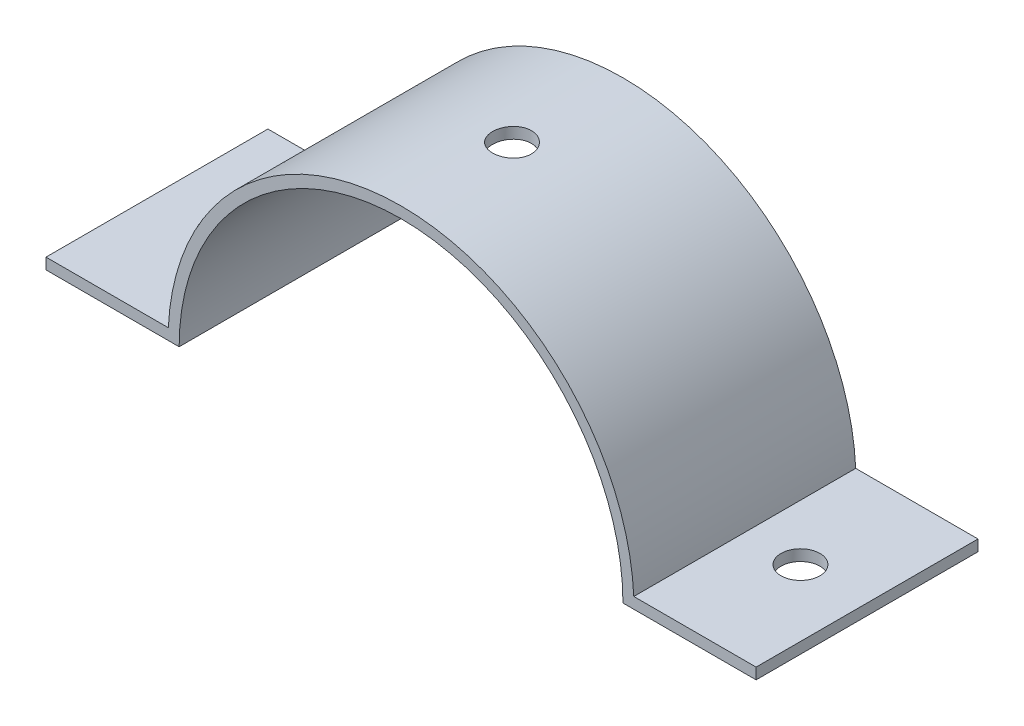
ISO-10303-21;
HEADER;
FILE_DESCRIPTION(('STEP AP214'),'2;1');
FILE_NAME('part.step','',(''),(''),'','','');
FILE_SCHEMA(('AUTOMOTIVE_DESIGN { 1 0 10303 214 1 1 1 1 }'));
ENDSEC;
DATA;
#1=APPLICATION_CONTEXT('core data for automotive mechanical design processes');
#2=APPLICATION_PROTOCOL_DEFINITION('international standard','automotive_design',2000,#1);
#3=PRODUCT_CONTEXT('',#1,'mechanical');
#4=PRODUCT('Part','Part','',(#3));
#5=PRODUCT_RELATED_PRODUCT_CATEGORY('part','',(#4));
#6=PRODUCT_DEFINITION_FORMATION('','',#4);
#7=PRODUCT_DEFINITION_CONTEXT('part definition',#1,'design');
#8=PRODUCT_DEFINITION('design','',#6,#7);
#9=PRODUCT_DEFINITION_SHAPE('','',#8);
#10=(LENGTH_UNIT() NAMED_UNIT(*) SI_UNIT(.MILLI.,.METRE.));
#11=(NAMED_UNIT(*) PLANE_ANGLE_UNIT() SI_UNIT($,.RADIAN.));
#12=(NAMED_UNIT(*) SI_UNIT($,.STERADIAN.) SOLID_ANGLE_UNIT());
#13=UNCERTAINTY_MEASURE_WITH_UNIT(LENGTH_MEASURE(1.E-05),#10,'distance_accuracy_value','');
#14=(GEOMETRIC_REPRESENTATION_CONTEXT(3) GLOBAL_UNCERTAINTY_ASSIGNED_CONTEXT((#13)) GLOBAL_UNIT_ASSIGNED_CONTEXT((#10,
#11,#12)) REPRESENTATION_CONTEXT('',''));
#15=CARTESIAN_POINT('',(0.,0.,0.));
#16=DIRECTION('',(0.,0.,1.));
#17=DIRECTION('',(1.,0.,0.));
#18=AXIS2_PLACEMENT_3D('',#15,#16,#17);
#19=CARTESIAN_POINT('',(0.,0.,20.));
#20=DIRECTION('',(0.,0.,-1.));
#21=DIRECTION('',(-1.,0.,0.));
#22=AXIS2_PLACEMENT_3D('',#19,#20,#21);
#23=CYLINDRICAL_SURFACE('',#22,21.);
#24=CARTESIAN_POINT('',(0.,0.,0.));
#25=DIRECTION('',(0.,0.,1.));
#26=DIRECTION('',(1.,0.,0.));
#27=AXIS2_PLACEMENT_3D('',#24,#25,#26);
#28=CIRCLE('',#27,21.);
#29=CARTESIAN_POINT('',(20.976176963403,1.,0.));
#30=VERTEX_POINT('',#29);
#31=CARTESIAN_POINT('',(-20.976176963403,1.,0.));
#32=VERTEX_POINT('',#31);
#33=EDGE_CURVE('E134',#30,#32,#28,.T.);
#34=ORIENTED_EDGE('',*,*,#33,.T.);
#35=DIRECTION('',(0.,0.,-1.));
#36=VECTOR('',#35,1.);
#37=CARTESIAN_POINT('',(-20.976176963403,1.,20.));
#38=LINE('',#37,#36);
#39=CARTESIAN_POINT('',(-20.976176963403,1.,20.));
#40=VERTEX_POINT('',#39);
#41=EDGE_CURVE('E11',#40,#32,#38,.T.);
#42=ORIENTED_EDGE('',*,*,#41,.F.);
#43=CARTESIAN_POINT('',(0.,0.,20.));
#44=DIRECTION('',(0.,0.,1.));
#45=DIRECTION('',(1.,0.,0.));
#46=AXIS2_PLACEMENT_3D('',#43,#44,#45);
#47=CIRCLE('',#46,21.);
#48=CARTESIAN_POINT('',(20.976176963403,1.,20.));
#49=VERTEX_POINT('',#48);
#50=EDGE_CURVE('E149',#49,#40,#47,.T.);
#51=ORIENTED_EDGE('',*,*,#50,.F.);
#52=DIRECTION('',(0.,0.,-1.));
#53=VECTOR('',#52,1.);
#54=CARTESIAN_POINT('',(20.976176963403,1.,20.));
#55=LINE('',#54,#53);
#56=EDGE_CURVE('E130',#49,#30,#55,.T.);
#57=ORIENTED_EDGE('',*,*,#56,.T.);
#58=EDGE_LOOP('',(#34,#42,#51,#57));
#59=FACE_BOUND('',#58,.T.);
#60=CARTESIAN_POINT('',(0.,21.,8.25));
#61=CARTESIAN_POINT('',(-0.0981156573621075,20.9999990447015,8.25000428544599));
#62=CARTESIAN_POINT('',(-0.196298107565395,20.9993050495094,8.25827919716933));
#63=CARTESIAN_POINT('',(-0.389946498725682,20.9966032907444,8.29116761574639));
#64=CARTESIAN_POINT('',(-0.485409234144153,20.9945940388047,8.31579963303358));
#65=CARTESIAN_POINT('',(-0.670785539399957,20.9894888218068,8.3806850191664));
#66=CARTESIAN_POINT('',(-0.760702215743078,20.9863934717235,8.42092954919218));
#67=CARTESIAN_POINT('',(-0.932482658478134,20.9794631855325,8.51588175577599));
#68=CARTESIAN_POINT('',(-1.01434814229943,20.9756284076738,8.57058633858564));
#69=CARTESIAN_POINT('',(-1.16793249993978,20.9676386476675,8.69305636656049));
#70=CARTESIAN_POINT('',(-1.23962802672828,20.9634829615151,8.76085104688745));
#71=CARTESIAN_POINT('',(-1.37063698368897,20.9553256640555,8.90751506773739));
#72=CARTESIAN_POINT('',(-1.42994986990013,20.9513240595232,8.98638489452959));
#73=CARTESIAN_POINT('',(-1.5345888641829,20.9439204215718,9.1531017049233));
#74=CARTESIAN_POINT('',(-1.5798944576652,20.9405192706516,9.24096160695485));
#75=CARTESIAN_POINT('',(-1.65510175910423,20.9347096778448,9.42307451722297));
#76=CARTESIAN_POINT('',(-1.68500373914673,20.9323012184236,9.51732741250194));
#77=CARTESIAN_POINT('',(-1.7284873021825,20.9287556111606,9.70931693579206));
#78=CARTESIAN_POINT('',(-1.74210691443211,20.9276155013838,9.80704489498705));
#79=CARTESIAN_POINT('',(-1.752756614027,20.9267263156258,10.0034058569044));
#80=CARTESIAN_POINT('',(-1.74978701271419,20.9269772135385,10.1020388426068));
#81=CARTESIAN_POINT('',(-1.72737401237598,20.9288390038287,10.2971494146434));
#82=CARTESIAN_POINT('',(-1.7079719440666,20.9304464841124,10.3936317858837));
#83=CARTESIAN_POINT('',(-1.65330897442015,20.9348349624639,10.5819657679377));
#84=CARTESIAN_POINT('',(-1.61804791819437,20.937615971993,10.6738173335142));
#85=CARTESIAN_POINT('',(-1.53262162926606,20.9440420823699,10.8504140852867));
#86=CARTESIAN_POINT('',(-1.48243785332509,20.9476882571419,10.9351502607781));
#87=CARTESIAN_POINT('',(-1.36860402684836,20.9554328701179,11.0950123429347));
#88=CARTESIAN_POINT('',(-1.30495370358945,20.9595313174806,11.1701380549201));
#89=CARTESIAN_POINT('',(-1.16576176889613,20.9677338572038,11.3088869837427));
#90=CARTESIAN_POINT('',(-1.09018442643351,20.9718379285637,11.3724743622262));
#91=CARTESIAN_POINT('',(-0.929408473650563,20.9795773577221,11.48606451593));
#92=CARTESIAN_POINT('',(-0.844209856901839,20.9832127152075,11.5360672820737));
#93=CARTESIAN_POINT('',(-0.666586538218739,20.9896058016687,11.6210665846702));
#94=CARTESIAN_POINT('',(-0.574161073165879,20.9923634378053,11.6560615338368));
#95=CARTESIAN_POINT('',(-0.384718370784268,20.9966893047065,11.7100267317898));
#96=CARTESIAN_POINT('',(-0.287701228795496,20.9982575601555,11.7289973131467));
#97=CARTESIAN_POINT('',(-0.0921397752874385,21.0000247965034,11.7503303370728));
#98=CARTESIAN_POINT('',(0.00639910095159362,21.00022785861,11.7527422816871));
#99=CARTESIAN_POINT('',(0.202479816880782,20.9992527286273,11.7410192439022));
#100=CARTESIAN_POINT('',(0.300021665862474,20.9980745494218,11.7268844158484));
#101=CARTESIAN_POINT('',(0.491198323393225,20.9944720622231,11.6825100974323));
#102=CARTESIAN_POINT('',(0.584838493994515,20.9920495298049,11.6522935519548));
#103=CARTESIAN_POINT('',(0.765719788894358,20.9862304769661,11.5766369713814));
#104=CARTESIAN_POINT('',(0.852960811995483,20.9828339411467,11.5311966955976));
#105=CARTESIAN_POINT('',(1.01879263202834,20.9754374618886,11.4262581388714));
#106=CARTESIAN_POINT('',(1.09736261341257,20.9714361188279,11.3667270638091));
#107=CARTESIAN_POINT('',(1.24341191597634,20.9632842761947,11.2353441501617));
#108=CARTESIAN_POINT('',(1.31089104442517,20.9591337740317,11.1634920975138));
#109=CARTESIAN_POINT('',(1.43301295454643,20.9511393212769,11.0092920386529));
#110=CARTESIAN_POINT('',(1.48762343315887,20.9472961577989,10.9269184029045));
#111=CARTESIAN_POINT('',(1.58223635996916,20.9403626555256,10.754141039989));
#112=CARTESIAN_POINT('',(1.62223895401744,20.937272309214,10.6637373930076));
#113=CARTESIAN_POINT('',(1.68644556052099,20.9321987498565,10.4775806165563));
#114=CARTESIAN_POINT('',(1.71066934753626,20.9302141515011,10.3818343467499));
#115=CARTESIAN_POINT('',(1.74269509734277,20.9275721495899,10.1876162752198));
#116=CARTESIAN_POINT('',(1.75049737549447,20.926914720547,10.0891445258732));
#117=CARTESIAN_POINT('',(1.74945498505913,20.9270018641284,9.89259177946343));
#118=CARTESIAN_POINT('',(1.74066107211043,20.9277421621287,9.79451050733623));
#119=CARTESIAN_POINT('',(1.7067817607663,20.9305322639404,9.60122306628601));
#120=CARTESIAN_POINT('',(1.68169633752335,20.9325820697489,9.50601690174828));
#121=CARTESIAN_POINT('',(1.61595894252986,20.9377590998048,9.32117891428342));
#122=CARTESIAN_POINT('',(1.57530788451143,20.9408862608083,9.23154676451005));
#123=CARTESIAN_POINT('',(1.47959885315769,20.9478657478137,9.06037102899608));
#124=CARTESIAN_POINT('',(1.42454110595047,20.9517180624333,8.97882731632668));
#125=CARTESIAN_POINT('',(1.30139089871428,20.9597278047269,8.82588345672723));
#126=CARTESIAN_POINT('',(1.23326086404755,20.9638860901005,8.75451360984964));
#127=CARTESIAN_POINT('',(1.08596814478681,20.9720314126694,8.62419342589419));
#128=CARTESIAN_POINT('',(1.00680279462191,20.9760184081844,8.56524609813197));
#129=CARTESIAN_POINT('',(0.839534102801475,20.9833791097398,8.46136524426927));
#130=CARTESIAN_POINT('',(0.751414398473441,20.9867516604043,8.41645800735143));
#131=CARTESIAN_POINT('',(0.568917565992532,20.9924899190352,8.34213434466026));
#132=CARTESIAN_POINT('',(0.474547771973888,20.9948567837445,8.31270011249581));
#133=CARTESIAN_POINT('',(0.316351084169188,20.9977093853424,8.27765423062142));
#134=CARTESIAN_POINT('',(0.253541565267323,20.9985644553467,8.2672976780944));
#135=CARTESIAN_POINT('',(0.127164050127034,20.9997100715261,8.25346918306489));
#136=CARTESIAN_POINT('',(0.0635960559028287,21.0000006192,8.24999722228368));
#137=CARTESIAN_POINT('',(0.,21.,8.25));
#138=B_SPLINE_CURVE_WITH_KNOTS('',3,(#60,#61,#62,#63,#64,#65,#66,#67,#68,#69,#70,#71,#72,#73,
#74,#75,#76,#77,#78,#79,#80,#81,#82,#83,#84,#85,#86,#87,#88,#89,#90,#91,#92,#93,#94,#95,#96,#97,
#98,#99,#100,#101,#102,#103,#104,#105,#106,#107,#108,#109,#110,#111,#112,#113,#114,#115,#116,
#117,#118,#119,#120,#121,#122,#123,#124,#125,#126,#127,#128,#129,#130,#131,#132,#133,#134,#135,
#136,#137),.UNSPECIFIED.,.T.,.F.,(4,2,2,2,2,2,2,2,2,2,2,2,2,2,2,2,2,2,2,2,2,2,2,2,2,2,2,2,2,2,2,
2,2,2,2,2,2,2,4),(0.,0.294114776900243,0.588562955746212,0.882844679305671,1.17706349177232,
1.47194717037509,1.7668438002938,2.0621703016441,2.35749158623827,2.65212175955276,
2.94674640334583,3.24063220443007,3.53452087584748,3.82877627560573,4.12303763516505,
4.41819789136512,4.71335834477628,5.00855000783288,5.30373554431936,5.59803823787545,
5.89233818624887,6.18621935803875,6.48010517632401,6.77468181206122,7.06926356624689,
7.36457708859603,7.65988766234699,7.95482742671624,8.24976152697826,8.54379510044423,
8.83782912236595,9.13184588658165,9.42585803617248,9.72072830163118,10.0156699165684,
10.3111605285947,10.6063103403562,10.7969485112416,10.9875861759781),.UNSPECIFIED.);
#139=CARTESIAN_POINT('',(0.,21.,8.25));
#140=VERTEX_POINT('',#139);
#141=EDGE_CURVE('E169',#140,#140,#138,.T.);
#142=ORIENTED_EDGE('',*,*,#141,.F.);
#143=EDGE_LOOP('',(#142));
#144=FACE_BOUND('',#143,.T.);
#145=ADVANCED_FACE('F31',(#59,#144),#23,.T.);
#146=CARTESIAN_POINT('',(0.,0.,20.));
#147=DIRECTION('',(0.,0.,-1.));
#148=DIRECTION('',(-1.,0.,0.));
#149=AXIS2_PLACEMENT_3D('',#146,#147,#148);
#150=CYLINDRICAL_SURFACE('',#149,20.);
#151=CARTESIAN_POINT('',(0.,0.,0.));
#152=DIRECTION('',(0.,0.,-1.));
#153=DIRECTION('',(1.,0.,0.));
#154=AXIS2_PLACEMENT_3D('',#151,#152,#153);
#155=CIRCLE('',#154,20.);
#156=CARTESIAN_POINT('',(-20.,0.,0.));
#157=VERTEX_POINT('',#156);
#158=CARTESIAN_POINT('',(20.,0.,0.));
#159=VERTEX_POINT('',#158);
#160=EDGE_CURVE('E144',#157,#159,#155,.T.);
#161=ORIENTED_EDGE('',*,*,#160,.T.);
#162=DIRECTION('',(0.,0.,-1.));
#163=VECTOR('',#162,1.);
#164=CARTESIAN_POINT('',(20.,0.,20.));
#165=LINE('',#164,#163);
#166=CARTESIAN_POINT('',(20.,0.,20.));
#167=VERTEX_POINT('',#166);
#168=EDGE_CURVE('E125',#167,#159,#165,.T.);
#169=ORIENTED_EDGE('',*,*,#168,.F.);
#170=CARTESIAN_POINT('',(0.,0.,20.));
#171=DIRECTION('',(0.,0.,-1.));
#172=DIRECTION('',(1.,0.,0.));
#173=AXIS2_PLACEMENT_3D('',#170,#171,#172);
#174=CIRCLE('',#173,20.);
#175=CARTESIAN_POINT('',(-20.,0.,20.));
#176=VERTEX_POINT('',#175);
#177=EDGE_CURVE('E116',#176,#167,#174,.T.);
#178=ORIENTED_EDGE('',*,*,#177,.F.);
#179=DIRECTION('',(0.,0.,-1.));
#180=VECTOR('',#179,1.);
#181=CARTESIAN_POINT('',(-20.,0.,20.));
#182=LINE('',#181,#180);
#183=EDGE_CURVE('E153',#176,#157,#182,.T.);
#184=ORIENTED_EDGE('',*,*,#183,.T.);
#185=EDGE_LOOP('',(#161,#169,#178,#184));
#186=FACE_BOUND('',#185,.T.);
#187=CARTESIAN_POINT('',(0.,20.,8.25));
#188=CARTESIAN_POINT('',(0.0980969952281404,19.9999990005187,8.25000427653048));
#189=CARTESIAN_POINT('',(0.19626032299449,19.9992705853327,8.25827605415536));
#190=CARTESIAN_POINT('',(0.389869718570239,19.9964348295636,8.29115129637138));
#191=CARTESIAN_POINT('',(0.485312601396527,19.994325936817,8.3157731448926));
#192=CARTESIAN_POINT('',(0.670649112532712,19.9889674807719,8.38062994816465));
#193=CARTESIAN_POINT('',(0.760545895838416,19.985718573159,8.42085592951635));
#194=CARTESIAN_POINT('',(0.932290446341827,19.9784441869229,8.5157627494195));
#195=CARTESIAN_POINT('',(1.01413990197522,19.9744188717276,8.57044054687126));
#196=CARTESIAN_POINT('',(1.16771612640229,19.9660306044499,8.69286357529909));
#197=CARTESIAN_POINT('',(1.23941729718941,19.961666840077,8.76064086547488));
#198=CARTESIAN_POINT('',(1.37044188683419,19.9531002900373,8.90727100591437));
#199=CARTESIAN_POINT('',(1.42976475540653,19.948897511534,8.98612434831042));
#200=CARTESIAN_POINT('',(1.53443650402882,19.9411201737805,9.15282462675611));
#201=CARTESIAN_POINT('',(1.57976270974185,19.9375466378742,9.24068585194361));
#202=CARTESIAN_POINT('',(1.65500966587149,19.9314419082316,9.42280837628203));
#203=CARTESIAN_POINT('',(1.68493071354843,19.9289106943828,9.51706955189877));
#204=CARTESIAN_POINT('',(1.72844331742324,19.9251841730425,9.70905850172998));
#205=CARTESIAN_POINT('',(1.74207678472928,19.9239854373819,9.80677670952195));
#206=CARTESIAN_POINT('',(1.75275671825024,19.9230488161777,10.003121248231));
#207=CARTESIAN_POINT('',(1.74980352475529,19.9233109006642,10.1017475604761));
#208=CARTESIAN_POINT('',(1.72742858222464,19.9252631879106,10.2968210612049));
#209=CARTESIAN_POINT('',(1.70805243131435,19.9269494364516,10.3932735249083));
#210=CARTESIAN_POINT('',(1.65345245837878,19.9315538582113,10.5815520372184));
#211=CARTESIAN_POINT('',(1.61822846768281,19.9344720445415,10.6733780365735));
#212=CARTESIAN_POINT('',(1.53288180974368,19.9412160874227,10.849942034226));
#213=CARTESIAN_POINT('',(1.48273873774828,19.9450431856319,10.9346701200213));
#214=CARTESIAN_POINT('',(1.36899199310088,19.9531727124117,11.094524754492));
#215=CARTESIAN_POINT('',(1.30538801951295,19.9574751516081,11.1696510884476));
#216=CARTESIAN_POINT('',(1.16626945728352,19.9660881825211,11.3084347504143));
#217=CARTESIAN_POINT('',(1.09071545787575,19.9703987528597,11.3720525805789));
#218=CARTESIAN_POINT('',(0.929978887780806,19.9785285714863,11.4857077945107));
#219=CARTESIAN_POINT('',(0.844796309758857,19.9823478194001,11.5357451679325));
#220=CARTESIAN_POINT('',(0.667194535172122,19.9890655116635,11.6208168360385));
#221=CARTESIAN_POINT('',(0.574774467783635,19.9919638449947,11.6558493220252));
#222=CARTESIAN_POINT('',(0.385333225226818,19.9965119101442,11.7098888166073));
#223=CARTESIAN_POINT('',(0.288312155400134,19.9981616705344,11.7288961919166));
#224=CARTESIAN_POINT('',(0.0927652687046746,20.0000230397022,11.7502962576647));
#225=CARTESIAN_POINT('',(-0.00575453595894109,20.0002393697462,11.7527434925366));
#226=CARTESIAN_POINT('',(-0.201802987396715,19.9992221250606,11.7410967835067));
#227=CARTESIAN_POINT('',(-0.299331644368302,19.9979885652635,11.7270030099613));
#228=CARTESIAN_POINT('',(-0.490473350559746,19.9942132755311,11.6827195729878));
#229=CARTESIAN_POINT('',(-0.584092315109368,19.9916736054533,11.6525552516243));
#230=CARTESIAN_POINT('',(-0.764940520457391,19.9855713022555,11.5770128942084));
#231=CARTESIAN_POINT('',(-0.852169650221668,19.9820086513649,11.5316345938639));
#232=CARTESIAN_POINT('',(-1.0180099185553,19.9742477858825,11.4268157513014));
#233=CARTESIAN_POINT('',(-1.09659818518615,19.9700479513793,11.3673391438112));
#234=CARTESIAN_POINT('',(-1.24269486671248,19.9614898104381,11.236064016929));
#235=CARTESIAN_POINT('',(-1.31020306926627,19.9571315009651,11.1642652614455));
#236=CARTESIAN_POINT('',(-1.43241094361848,19.9487335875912,11.0101469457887));
#237=CARTESIAN_POINT('',(-1.48707497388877,19.9446948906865,10.9277990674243));
#238=CARTESIAN_POINT('',(-1.58179826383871,19.9374065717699,10.7550607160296));
#239=CARTESIAN_POINT('',(-1.62185768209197,19.9341569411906,10.6646703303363));
#240=CARTESIAN_POINT('',(-1.68617413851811,19.9288199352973,10.4785380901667));
#241=CARTESIAN_POINT('',(-1.71045285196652,19.9267309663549,10.3828037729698));
#242=CARTESIAN_POINT('',(-1.74258923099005,19.9239465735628,10.188598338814));
#243=CARTESIAN_POINT('',(-1.75044724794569,19.9232511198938,10.0901272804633));
#244=CARTESIAN_POINT('',(-1.74951492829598,19.9233329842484,9.89359780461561));
#245=CARTESIAN_POINT('',(-1.74078058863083,19.9241053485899,9.79553911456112));
#246=CARTESIAN_POINT('',(-1.70702840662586,19.9270252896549,9.60228721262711));
#247=CARTESIAN_POINT('',(-1.6820105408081,19.9291728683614,9.50709400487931));
#248=CARTESIAN_POINT('',(-1.61641596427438,19.9345999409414,9.32227258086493));
#249=CARTESIAN_POINT('',(-1.57584041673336,19.9378793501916,9.23264394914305));
#250=CARTESIAN_POINT('',(-1.48028839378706,19.9452007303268,9.06146136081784));
#251=CARTESIAN_POINT('',(-1.42531211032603,19.9492426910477,8.97990729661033));
#252=CARTESIAN_POINT('',(-1.302308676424,19.9576500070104,8.82690211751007));
#253=CARTESIAN_POINT('',(-1.23423997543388,19.9620163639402,8.75548446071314));
#254=CARTESIAN_POINT('',(-1.08706141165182,19.9705713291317,8.62505760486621));
#255=CARTESIAN_POINT('',(-1.00794888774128,19.9747598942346,8.56605140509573));
#256=CARTESIAN_POINT('',(-0.840760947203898,19.9824956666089,8.46203473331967));
#257=CARTESIAN_POINT('',(-0.752667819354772,19.986041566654,8.41705265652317));
#258=CARTESIAN_POINT('',(-0.570207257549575,19.9920774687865,8.34257675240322));
#259=CARTESIAN_POINT('',(-0.475847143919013,19.9945686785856,8.31306520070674));
#260=CARTESIAN_POINT('',(-0.317446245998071,19.9975781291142,8.27784755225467));
#261=CARTESIAN_POINT('',(-0.254422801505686,19.9984821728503,8.26741869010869));
#262=CARTESIAN_POINT('',(-0.127608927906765,19.999693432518,8.25349353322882));
#263=CARTESIAN_POINT('',(-0.0638185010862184,20.0000006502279,8.24999721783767));
#264=CARTESIAN_POINT('',(0.,20.,8.25));
#265=B_SPLINE_CURVE_WITH_KNOTS('',3,(#187,#188,#189,#190,#191,#192,#193,#194,#195,#196,#197,
#198,#199,#200,#201,#202,#203,#204,#205,#206,#207,#208,#209,#210,#211,#212,#213,#214,#215,#216,
#217,#218,#219,#220,#221,#222,#223,#224,#225,#226,#227,#228,#229,#230,#231,#232,#233,#234,#235,
#236,#237,#238,#239,#240,#241,#242,#243,#244,#245,#246,#247,#248,#249,#250,#251,#252,#253,#254,
#255,#256,#257,#258,#259,#260,#261,#262,#263,#264),.UNSPECIFIED.,.T.,.F.,(4,2,2,2,2,2,2,2,2,2,2,
2,2,2,2,2,2,2,2,2,2,2,2,2,2,2,2,2,2,2,2,2,2,2,2,2,2,2,4),(0.,0.294057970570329,
0.588447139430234,0.882667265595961,1.17682552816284,1.47171303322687,1.76661364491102,
2.06198951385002,2.35735968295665,2.65196815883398,2.94657059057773,3.24035773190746,
3.5341480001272,3.82834194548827,4.12254246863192,4.41773430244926,4.71292636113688,
5.00815399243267,5.30337486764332,5.5976228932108,5.89186788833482,6.18565024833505,
6.47943771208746,6.77398499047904,7.06853791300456,7.36389878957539,7.65925645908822,
7.95420758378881,8.24915239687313,8.54310357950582,8.83705518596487,9.13098481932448,
9.42491053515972,9.71978493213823,10.014730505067,10.3102694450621,10.6054690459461,
10.7967735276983,10.9880774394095),.UNSPECIFIED.);
#266=CARTESIAN_POINT('',(0.,20.,8.25));
#267=VERTEX_POINT('',#266);
#268=EDGE_CURVE('E35',#267,#267,#265,.T.);
#269=ORIENTED_EDGE('',*,*,#268,.F.);
#270=EDGE_LOOP('',(#269));
#271=FACE_BOUND('',#270,.T.);
#272=ADVANCED_FACE('F194',(#186,#271),#150,.F.);
#273=CARTESIAN_POINT('',(-20.976176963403,1.,20.));
#274=DIRECTION('',(0.,-1.,0.));
#275=DIRECTION('',(0.,0.,-1.));
#276=AXIS2_PLACEMENT_3D('',#273,#274,#275);
#277=PLANE('',#276);
#278=CARTESIAN_POINT('',(-26.,1.,10.));
#279=DIRECTION('',(0.,1.,0.));
#280=DIRECTION('',(0.,0.,1.));
#281=AXIS2_PLACEMENT_3D('',#278,#279,#280);
#282=CIRCLE('',#281,1.75);
#283=CARTESIAN_POINT('',(-26.,1.,11.75));
#284=VERTEX_POINT('',#283);
#285=EDGE_CURVE('E163',#284,#284,#282,.T.);
#286=ORIENTED_EDGE('',*,*,#285,.F.);
#287=EDGE_LOOP('',(#286));
#288=FACE_BOUND('',#287,.T.);
#289=DIRECTION('',(-1.,0.,0.));
#290=VECTOR('',#289,1.);
#291=CARTESIAN_POINT('',(-20.976176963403,1.,0.));
#292=LINE('',#291,#290);
#293=CARTESIAN_POINT('',(-32.,1.,0.));
#294=VERTEX_POINT('',#293);
#295=EDGE_CURVE('E137',#32,#294,#292,.T.);
#296=ORIENTED_EDGE('',*,*,#295,.T.);
#297=DIRECTION('',(0.,0.,-1.));
#298=VECTOR('',#297,1.);
#299=CARTESIAN_POINT('',(-32.,1.,20.));
#300=LINE('',#299,#298);
#301=CARTESIAN_POINT('',(-32.,1.,20.));
#302=VERTEX_POINT('',#301);
#303=EDGE_CURVE('E45',#302,#294,#300,.T.);
#304=ORIENTED_EDGE('',*,*,#303,.F.);
#305=DIRECTION('',(-1.,0.,0.));
#306=VECTOR('',#305,1.);
#307=CARTESIAN_POINT('',(-20.976176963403,1.,20.));
#308=LINE('',#307,#306);
#309=EDGE_CURVE('E97',#40,#302,#308,.T.);
#310=ORIENTED_EDGE('',*,*,#309,.F.);
#311=ORIENTED_EDGE('',*,*,#41,.T.);
#312=EDGE_LOOP('',(#296,#304,#310,#311));
#313=FACE_BOUND('',#312,.T.);
#314=ADVANCED_FACE('F221',(#288,#313),#277,.F.);
#315=CARTESIAN_POINT('',(-32.,1.,20.));
#316=DIRECTION('',(1.,0.,0.));
#317=DIRECTION('',(0.,0.,-1.));
#318=AXIS2_PLACEMENT_3D('',#315,#316,#317);
#319=PLANE('',#318);
#320=DIRECTION('',(0.,-1.,0.));
#321=VECTOR('',#320,1.);
#322=CARTESIAN_POINT('',(-32.,1.,0.));
#323=LINE('',#322,#321);
#324=CARTESIAN_POINT('',(-32.,0.,0.));
#325=VERTEX_POINT('',#324);
#326=EDGE_CURVE('E140',#294,#325,#323,.T.);
#327=ORIENTED_EDGE('',*,*,#326,.T.);
#328=DIRECTION('',(0.,0.,-1.));
#329=VECTOR('',#328,1.);
#330=CARTESIAN_POINT('',(-32.,0.,20.));
#331=LINE('',#330,#329);
#332=CARTESIAN_POINT('',(-32.,0.,20.));
#333=VERTEX_POINT('',#332);
#334=EDGE_CURVE('E156',#333,#325,#331,.T.);
#335=ORIENTED_EDGE('',*,*,#334,.F.);
#336=DIRECTION('',(0.,-1.,0.));
#337=VECTOR('',#336,1.);
#338=CARTESIAN_POINT('',(-32.,1.,20.));
#339=LINE('',#338,#337);
#340=EDGE_CURVE('E182',#302,#333,#339,.T.);
#341=ORIENTED_EDGE('',*,*,#340,.F.);
#342=ORIENTED_EDGE('',*,*,#303,.T.);
#343=EDGE_LOOP('',(#327,#335,#341,#342));
#344=FACE_BOUND('',#343,.T.);
#345=ADVANCED_FACE('F226',(#344),#319,.F.);
#346=CARTESIAN_POINT('',(-20.,0.,20.));
#347=DIRECTION('',(0.,1.,0.));
#348=DIRECTION('',(-1.,0.,0.));
#349=AXIS2_PLACEMENT_3D('',#346,#347,#348);
#350=PLANE('',#349);
#351=CARTESIAN_POINT('',(-26.,0.,10.));
#352=DIRECTION('',(0.,1.,0.));
#353=DIRECTION('',(-1.,0.,0.));
#354=AXIS2_PLACEMENT_3D('',#351,#352,#353);
#355=CIRCLE('',#354,1.75);
#356=CARTESIAN_POINT('',(-27.75,0.,10.));
#357=VERTEX_POINT('',#356);
#358=EDGE_CURVE('E160',#357,#357,#355,.T.);
#359=ORIENTED_EDGE('',*,*,#358,.T.);
#360=EDGE_LOOP('',(#359));
#361=FACE_BOUND('',#360,.T.);
#362=DIRECTION('',(1.,0.,0.));
#363=VECTOR('',#362,1.);
#364=CARTESIAN_POINT('',(-20.,0.,0.));
#365=LINE('',#364,#363);
#366=EDGE_CURVE('E142',#325,#157,#365,.T.);
#367=ORIENTED_EDGE('',*,*,#366,.T.);
#368=ORIENTED_EDGE('',*,*,#183,.F.);
#369=DIRECTION('',(1.,0.,0.));
#370=VECTOR('',#369,1.);
#371=CARTESIAN_POINT('',(-20.,0.,20.));
#372=LINE('',#371,#370);
#373=EDGE_CURVE('E184',#333,#176,#372,.T.);
#374=ORIENTED_EDGE('',*,*,#373,.F.);
#375=ORIENTED_EDGE('',*,*,#334,.T.);
#376=EDGE_LOOP('',(#367,#368,#374,#375));
#377=FACE_BOUND('',#376,.T.);
#378=ADVANCED_FACE('F190',(#361,#377),#350,.F.);
#379=CARTESIAN_POINT('',(20.,0.,20.));
#380=DIRECTION('',(0.,1.,0.));
#381=DIRECTION('',(-1.,0.,0.));
#382=AXIS2_PLACEMENT_3D('',#379,#380,#381);
#383=PLANE('',#382);
#384=CARTESIAN_POINT('',(26.,0.,10.));
#385=DIRECTION('',(0.,1.,0.));
#386=DIRECTION('',(-1.,0.,0.));
#387=AXIS2_PLACEMENT_3D('',#384,#385,#386);
#388=CIRCLE('',#387,1.75);
#389=CARTESIAN_POINT('',(24.25,0.,10.));
#390=VERTEX_POINT('',#389);
#391=EDGE_CURVE('E138',#390,#390,#388,.T.);
#392=ORIENTED_EDGE('',*,*,#391,.T.);
#393=EDGE_LOOP('',(#392));
#394=FACE_BOUND('',#393,.T.);
#395=DIRECTION('',(1.,0.,0.));
#396=VECTOR('',#395,1.);
#397=CARTESIAN_POINT('',(20.,0.,0.));
#398=LINE('',#397,#396);
#399=CARTESIAN_POINT('',(32.,0.,0.));
#400=VERTEX_POINT('',#399);
#401=EDGE_CURVE('E124',#159,#400,#398,.T.);
#402=ORIENTED_EDGE('',*,*,#401,.T.);
#403=DIRECTION('',(0.,0.,-1.));
#404=VECTOR('',#403,1.);
#405=CARTESIAN_POINT('',(32.,0.,20.));
#406=LINE('',#405,#404);
#407=CARTESIAN_POINT('',(32.,0.,20.));
#408=VERTEX_POINT('',#407);
#409=EDGE_CURVE('E121',#408,#400,#406,.T.);
#410=ORIENTED_EDGE('',*,*,#409,.F.);
#411=DIRECTION('',(1.,0.,0.));
#412=VECTOR('',#411,1.);
#413=CARTESIAN_POINT('',(20.,0.,20.));
#414=LINE('',#413,#412);
#415=EDGE_CURVE('E110',#167,#408,#414,.T.);
#416=ORIENTED_EDGE('',*,*,#415,.F.);
#417=ORIENTED_EDGE('',*,*,#168,.T.);
#418=EDGE_LOOP('',(#402,#410,#416,#417));
#419=FACE_BOUND('',#418,.T.);
#420=ADVANCED_FACE('F122',(#394,#419),#383,.F.);
#421=CARTESIAN_POINT('',(32.,1.,20.));
#422=DIRECTION('',(-1.,0.,0.));
#423=DIRECTION('',(0.,0.,1.));
#424=AXIS2_PLACEMENT_3D('',#421,#422,#423);
#425=PLANE('',#424);
#426=DIRECTION('',(0.,1.,0.));
#427=VECTOR('',#426,1.);
#428=CARTESIAN_POINT('',(32.,1.,0.));
#429=LINE('',#428,#427);
#430=CARTESIAN_POINT('',(32.,1.,0.));
#431=VERTEX_POINT('',#430);
#432=EDGE_CURVE('E83',#400,#431,#429,.T.);
#433=ORIENTED_EDGE('',*,*,#432,.T.);
#434=DIRECTION('',(0.,0.,-1.));
#435=VECTOR('',#434,1.);
#436=CARTESIAN_POINT('',(32.,1.,20.));
#437=LINE('',#436,#435);
#438=CARTESIAN_POINT('',(32.,1.,20.));
#439=VERTEX_POINT('',#438);
#440=EDGE_CURVE('E126',#439,#431,#437,.T.);
#441=ORIENTED_EDGE('',*,*,#440,.F.);
#442=DIRECTION('',(0.,1.,0.));
#443=VECTOR('',#442,1.);
#444=CARTESIAN_POINT('',(32.,1.,20.));
#445=LINE('',#444,#443);
#446=EDGE_CURVE('E114',#408,#439,#445,.T.);
#447=ORIENTED_EDGE('',*,*,#446,.F.);
#448=ORIENTED_EDGE('',*,*,#409,.T.);
#449=EDGE_LOOP('',(#433,#441,#447,#448));
#450=FACE_BOUND('',#449,.T.);
#451=ADVANCED_FACE('F128',(#450),#425,.F.);
#452=CARTESIAN_POINT('',(20.976176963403,1.,20.));
#453=DIRECTION('',(0.,-1.,0.));
#454=DIRECTION('',(0.,0.,-1.));
#455=AXIS2_PLACEMENT_3D('',#452,#453,#454);
#456=PLANE('',#455);
#457=CARTESIAN_POINT('',(26.,1.,10.));
#458=DIRECTION('',(0.,1.,0.));
#459=DIRECTION('',(0.,0.,1.));
#460=AXIS2_PLACEMENT_3D('',#457,#458,#459);
#461=CIRCLE('',#460,1.75);
#462=CARTESIAN_POINT('',(26.,1.,11.75));
#463=VERTEX_POINT('',#462);
#464=EDGE_CURVE('E162',#463,#463,#461,.T.);
#465=ORIENTED_EDGE('',*,*,#464,.F.);
#466=EDGE_LOOP('',(#465));
#467=FACE_BOUND('',#466,.T.);
#468=DIRECTION('',(-1.,0.,0.));
#469=VECTOR('',#468,1.);
#470=CARTESIAN_POINT('',(20.976176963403,1.,0.));
#471=LINE('',#470,#469);
#472=EDGE_CURVE('E89',#431,#30,#471,.T.);
#473=ORIENTED_EDGE('',*,*,#472,.T.);
#474=ORIENTED_EDGE('',*,*,#56,.F.);
#475=DIRECTION('',(-1.,0.,0.));
#476=VECTOR('',#475,1.);
#477=CARTESIAN_POINT('',(20.976176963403,1.,20.));
#478=LINE('',#477,#476);
#479=EDGE_CURVE('E54',#439,#49,#478,.T.);
#480=ORIENTED_EDGE('',*,*,#479,.F.);
#481=ORIENTED_EDGE('',*,*,#440,.T.);
#482=EDGE_LOOP('',(#473,#474,#480,#481));
#483=FACE_BOUND('',#482,.T.);
#484=ADVANCED_FACE('F204',(#467,#483),#456,.F.);
#485=CARTESIAN_POINT('',(0.,0.,20.));
#486=DIRECTION('',(0.,0.,1.));
#487=DIRECTION('',(1.,0.,0.));
#488=AXIS2_PLACEMENT_3D('',#485,#486,#487);
#489=PLANE('',#488);
#490=ORIENTED_EDGE('',*,*,#50,.T.);
#491=ORIENTED_EDGE('',*,*,#309,.T.);
#492=ORIENTED_EDGE('',*,*,#340,.T.);
#493=ORIENTED_EDGE('',*,*,#373,.T.);
#494=ORIENTED_EDGE('',*,*,#177,.T.);
#495=ORIENTED_EDGE('',*,*,#415,.T.);
#496=ORIENTED_EDGE('',*,*,#446,.T.);
#497=ORIENTED_EDGE('',*,*,#479,.T.);
#498=EDGE_LOOP('',(#490,#491,#492,#493,#494,#495,#496,#497));
#499=FACE_BOUND('',#498,.T.);
#500=ADVANCED_FACE('F112',(#499),#489,.T.);
#501=CARTESIAN_POINT('',(0.,0.,0.));
#502=DIRECTION('',(0.,0.,1.));
#503=DIRECTION('',(1.,0.,0.));
#504=AXIS2_PLACEMENT_3D('',#501,#502,#503);
#505=PLANE('',#504);
#506=ORIENTED_EDGE('',*,*,#33,.F.);
#507=ORIENTED_EDGE('',*,*,#472,.F.);
#508=ORIENTED_EDGE('',*,*,#432,.F.);
#509=ORIENTED_EDGE('',*,*,#401,.F.);
#510=ORIENTED_EDGE('',*,*,#160,.F.);
#511=ORIENTED_EDGE('',*,*,#366,.F.);
#512=ORIENTED_EDGE('',*,*,#326,.F.);
#513=ORIENTED_EDGE('',*,*,#295,.F.);
#514=EDGE_LOOP('',(#506,#507,#508,#509,#510,#511,#512,#513));
#515=FACE_BOUND('',#514,.T.);
#516=ADVANCED_FACE('F198',(#515),#505,.F.);
#517=CARTESIAN_POINT('',(26.,-19.,10.));
#518=DIRECTION('',(0.,1.,0.));
#519=DIRECTION('',(0.,0.,1.));
#520=AXIS2_PLACEMENT_3D('',#517,#518,#519);
#521=CYLINDRICAL_SURFACE('',#520,1.75);
#522=ORIENTED_EDGE('',*,*,#464,.T.);
#523=EDGE_LOOP('',(#522));
#524=FACE_BOUND('',#523,.T.);
#525=ORIENTED_EDGE('',*,*,#391,.F.);
#526=EDGE_LOOP('',(#525));
#527=FACE_BOUND('',#526,.T.);
#528=ADVANCED_FACE('F268',(#524,#527),#521,.F.);
#529=CARTESIAN_POINT('',(-26.,-19.,10.));
#530=DIRECTION('',(0.,1.,0.));
#531=DIRECTION('',(0.,0.,1.));
#532=AXIS2_PLACEMENT_3D('',#529,#530,#531);
#533=CYLINDRICAL_SURFACE('',#532,1.75);
#534=ORIENTED_EDGE('',*,*,#285,.T.);
#535=EDGE_LOOP('',(#534));
#536=FACE_BOUND('',#535,.T.);
#537=ORIENTED_EDGE('',*,*,#358,.F.);
#538=EDGE_LOOP('',(#537));
#539=FACE_BOUND('',#538,.T.);
#540=ADVANCED_FACE('F287',(#536,#539),#533,.F.);
#541=CARTESIAN_POINT('',(0.,21.,10.));
#542=DIRECTION('',(0.,-1.,0.));
#543=DIRECTION('',(0.,0.,-1.));
#544=AXIS2_PLACEMENT_3D('',#541,#542,#543);
#545=CYLINDRICAL_SURFACE('',#544,1.75);
#546=ORIENTED_EDGE('',*,*,#268,.T.);
#547=EDGE_LOOP('',(#546));
#548=FACE_BOUND('',#547,.T.);
#549=ORIENTED_EDGE('',*,*,#141,.T.);
#550=EDGE_LOOP('',(#549));
#551=FACE_BOUND('',#550,.T.);
#552=ADVANCED_FACE('F293',(#548,#551),#545,.F.);
#553=CLOSED_SHELL('',(#145,#272,#314,#345,#378,#420,#451,#484,#500,#516,#528,#540,#552));
#554=MANIFOLD_SOLID_BREP('B2',#553);
#555=ADVANCED_BREP_SHAPE_REPRESENTATION('',(#18,#554),#14);
#556=SHAPE_DEFINITION_REPRESENTATION(#9,#555);
ENDSEC;
END-ISO-10303-21;
